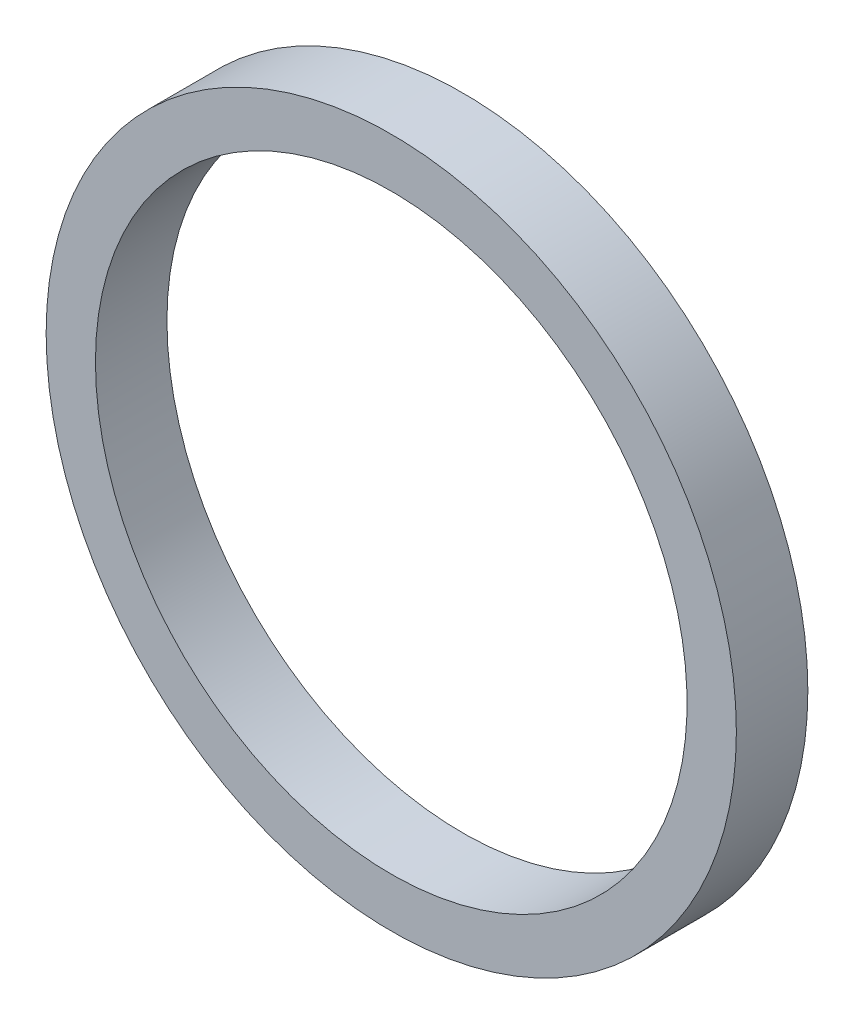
from build123d import *

# Parameters (mm, degrees)
SKETCH1_R      = 35
SKETCH1_R_2    = 30
EXTRUDE1_DEPTH = 7.25


with BuildPart() as part:
    # Sketch1 → Extrude1 (new body)
    with BuildSketch(Plane.XY):
        with Locations(Location((0, 0, 0), (0, 0, 180))):
            Circle(SKETCH1_R)
        with Locations(Location((0, 0, 0), (0, 0, 180))):
            Circle(SKETCH1_R_2, mode=Mode.SUBTRACT)
    extrude(amount=EXTRUDE1_DEPTH)


solid = part.part
